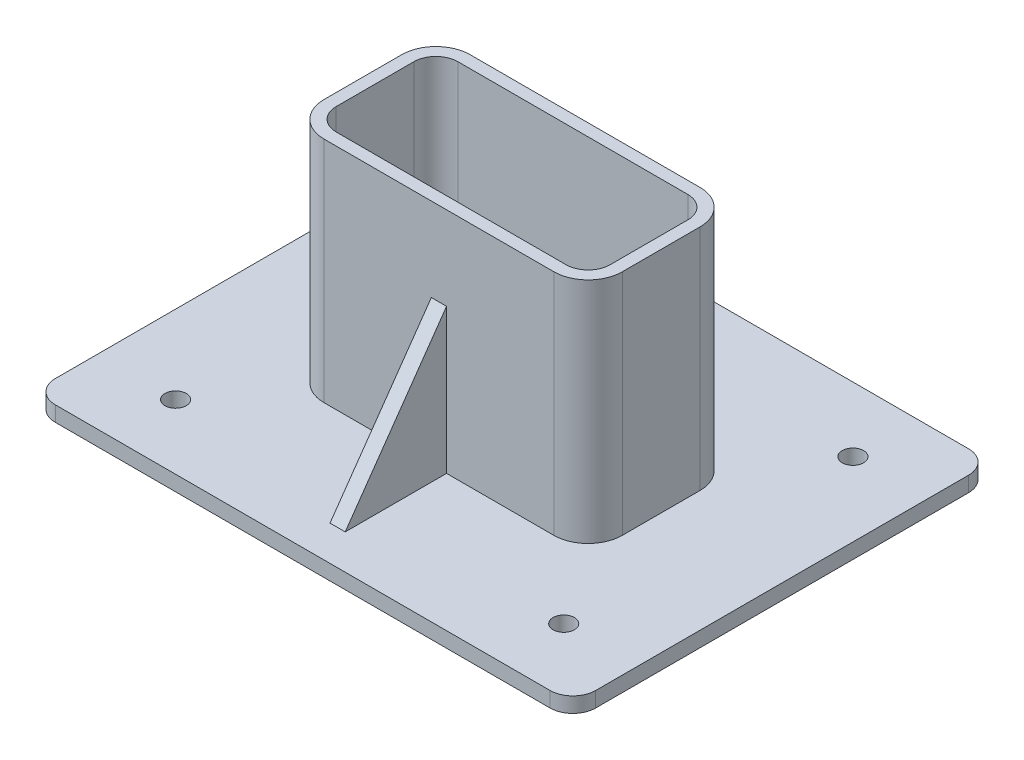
ISO-10303-21;
HEADER;
FILE_DESCRIPTION(('STEP AP214'),'2;1');
FILE_NAME('part.step','',(''),(''),'','','');
FILE_SCHEMA(('AUTOMOTIVE_DESIGN { 1 0 10303 214 1 1 1 1 }'));
ENDSEC;
DATA;
#1=APPLICATION_CONTEXT('core data for automotive mechanical design processes');
#2=APPLICATION_PROTOCOL_DEFINITION('international standard','automotive_design',2000,#1);
#3=PRODUCT_CONTEXT('',#1,'mechanical');
#4=PRODUCT('Part','Part','',(#3));
#5=PRODUCT_RELATED_PRODUCT_CATEGORY('part','',(#4));
#6=PRODUCT_DEFINITION_FORMATION('','',#4);
#7=PRODUCT_DEFINITION_CONTEXT('part definition',#1,'design');
#8=PRODUCT_DEFINITION('design','',#6,#7);
#9=PRODUCT_DEFINITION_SHAPE('','',#8);
#10=(LENGTH_UNIT() NAMED_UNIT(*) SI_UNIT(.MILLI.,.METRE.));
#11=(NAMED_UNIT(*) PLANE_ANGLE_UNIT() SI_UNIT($,.RADIAN.));
#12=(NAMED_UNIT(*) SI_UNIT($,.STERADIAN.) SOLID_ANGLE_UNIT());
#13=UNCERTAINTY_MEASURE_WITH_UNIT(LENGTH_MEASURE(1.E-05),#10,'distance_accuracy_value','');
#14=(GEOMETRIC_REPRESENTATION_CONTEXT(3) GLOBAL_UNCERTAINTY_ASSIGNED_CONTEXT((#13)) GLOBAL_UNIT_ASSIGNED_CONTEXT((#10,
#11,#12)) REPRESENTATION_CONTEXT('',''));
#15=CARTESIAN_POINT('',(0.,0.,0.));
#16=DIRECTION('',(0.,0.,1.));
#17=DIRECTION('',(1.,0.,0.));
#18=AXIS2_PLACEMENT_3D('',#15,#16,#17);
#19=CARTESIAN_POINT('',(90.,150.,0.));
#20=DIRECTION('',(1.,0.,0.));
#21=DIRECTION('',(0.,0.,-1.));
#22=AXIS2_PLACEMENT_3D('',#19,#20,#21);
#23=PLANE('',#22);
#24=DIRECTION('',(0.,0.,1.));
#25=VECTOR('',#24,1.);
#26=CARTESIAN_POINT('',(90.,0.,0.));
#27=LINE('',#26,#25);
#28=CARTESIAN_POINT('',(90.,0.,-25.5000000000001));
#29=VERTEX_POINT('',#28);
#30=CARTESIAN_POINT('',(90.,0.,25.5));
#31=VERTEX_POINT('',#30);
#32=EDGE_CURVE('E447',#29,#31,#27,.T.);
#33=ORIENTED_EDGE('',*,*,#32,.T.);
#34=DIRECTION('',(0.,-1.,0.));
#35=VECTOR('',#34,1.);
#36=CARTESIAN_POINT('',(90.,150.,25.5));
#37=LINE('',#36,#35);
#38=CARTESIAN_POINT('',(90.,150.,25.5));
#39=VERTEX_POINT('',#38);
#40=EDGE_CURVE('E503',#39,#31,#37,.T.);
#41=ORIENTED_EDGE('',*,*,#40,.F.);
#42=DIRECTION('',(0.,0.,1.));
#43=VECTOR('',#42,1.);
#44=CARTESIAN_POINT('',(90.,150.,0.));
#45=LINE('',#44,#43);
#46=CARTESIAN_POINT('',(90.,150.,-25.5000000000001));
#47=VERTEX_POINT('',#46);
#48=EDGE_CURVE('E387',#47,#39,#45,.T.);
#49=ORIENTED_EDGE('',*,*,#48,.F.);
#50=DIRECTION('',(0.,-1.,0.));
#51=VECTOR('',#50,1.);
#52=CARTESIAN_POINT('',(90.,150.,-25.5000000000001));
#53=LINE('',#52,#51);
#54=EDGE_CURVE('E474',#47,#29,#53,.T.);
#55=ORIENTED_EDGE('',*,*,#54,.T.);
#56=EDGE_LOOP('',(#33,#41,#49,#55));
#57=FACE_BOUND('',#56,.T.);
#58=ADVANCED_FACE('F53',(#57),#23,.F.);
#59=CARTESIAN_POINT('',(75.5,150.,25.5));
#60=DIRECTION('',(0.,-1.,0.));
#61=DIRECTION('',(0.,0.,-1.));
#62=AXIS2_PLACEMENT_3D('',#59,#60,#61);
#63=CYLINDRICAL_SURFACE('',#62,14.5);
#64=CARTESIAN_POINT('',(75.5,0.,25.5));
#65=DIRECTION('',(0.,1.,0.));
#66=DIRECTION('',(0.,0.,1.));
#67=AXIS2_PLACEMENT_3D('',#64,#65,#66);
#68=CIRCLE('',#67,14.5);
#69=CARTESIAN_POINT('',(75.5,0.,40.));
#70=VERTEX_POINT('',#69);
#71=EDGE_CURVE('E451',#31,#70,#68,.F.);
#72=ORIENTED_EDGE('',*,*,#71,.T.);
#73=DIRECTION('',(0.,-1.,0.));
#74=VECTOR('',#73,1.);
#75=CARTESIAN_POINT('',(75.5,150.,40.));
#76=LINE('',#75,#74);
#77=CARTESIAN_POINT('',(75.5,150.,40.));
#78=VERTEX_POINT('',#77);
#79=EDGE_CURVE('E499',#78,#70,#76,.T.);
#80=ORIENTED_EDGE('',*,*,#79,.F.);
#81=CARTESIAN_POINT('',(75.5,150.,25.5));
#82=DIRECTION('',(0.,1.,0.));
#83=DIRECTION('',(0.,0.,1.));
#84=AXIS2_PLACEMENT_3D('',#81,#82,#83);
#85=CIRCLE('',#84,14.5);
#86=EDGE_CURVE('E391',#39,#78,#85,.F.);
#87=ORIENTED_EDGE('',*,*,#86,.F.);
#88=ORIENTED_EDGE('',*,*,#40,.T.);
#89=EDGE_LOOP('',(#72,#80,#87,#88));
#90=FACE_BOUND('',#89,.T.);
#91=ADVANCED_FACE('F648',(#90),#63,.F.);
#92=CARTESIAN_POINT('',(0.,150.,40.));
#93=DIRECTION('',(0.,0.,-1.));
#94=DIRECTION('',(-1.,0.,0.));
#95=AXIS2_PLACEMENT_3D('',#92,#93,#94);
#96=PLANE('',#95);
#97=ORIENTED_EDGE('',*,*,#79,.T.);
#98=DIRECTION('',(1.,0.,0.));
#99=VECTOR('',#98,1.);
#100=CARTESIAN_POINT('',(0.,0.,40.));
#101=LINE('',#100,#99);
#102=CARTESIAN_POINT('',(-75.5,0.,40.0000000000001));
#103=VERTEX_POINT('',#102);
#104=EDGE_CURVE('E455',#103,#70,#101,.T.);
#105=ORIENTED_EDGE('',*,*,#104,.F.);
#106=DIRECTION('',(0.,-1.,0.));
#107=VECTOR('',#106,1.);
#108=CARTESIAN_POINT('',(-75.5,150.,40.0000000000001));
#109=LINE('',#108,#107);
#110=CARTESIAN_POINT('',(-75.5,150.,40.0000000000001));
#111=VERTEX_POINT('',#110);
#112=EDGE_CURVE('E495',#111,#103,#109,.T.);
#113=ORIENTED_EDGE('',*,*,#112,.F.);
#114=DIRECTION('',(1.,0.,0.));
#115=VECTOR('',#114,1.);
#116=CARTESIAN_POINT('',(0.,150.,40.));
#117=LINE('',#116,#115);
#118=EDGE_CURVE('E395',#111,#78,#117,.T.);
#119=ORIENTED_EDGE('',*,*,#118,.T.);
#120=EDGE_LOOP('',(#97,#105,#113,#119));
#121=FACE_BOUND('',#120,.T.);
#122=ADVANCED_FACE('F654',(#121),#96,.T.);
#123=CARTESIAN_POINT('',(-75.5,150.,25.5000000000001));
#124=DIRECTION('',(0.,-1.,0.));
#125=DIRECTION('',(0.,0.,-1.));
#126=AXIS2_PLACEMENT_3D('',#123,#124,#125);
#127=CYLINDRICAL_SURFACE('',#126,14.5);
#128=CARTESIAN_POINT('',(-75.5,0.,25.5000000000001));
#129=DIRECTION('',(0.,1.,0.));
#130=DIRECTION('',(0.,0.,1.));
#131=AXIS2_PLACEMENT_3D('',#128,#129,#130);
#132=CIRCLE('',#131,14.5);
#133=CARTESIAN_POINT('',(-90.,0.,25.5000000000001));
#134=VERTEX_POINT('',#133);
#135=EDGE_CURVE('E458',#134,#103,#132,.T.);
#136=ORIENTED_EDGE('',*,*,#135,.F.);
#137=DIRECTION('',(0.,-1.,0.));
#138=VECTOR('',#137,1.);
#139=CARTESIAN_POINT('',(-90.,150.,25.5000000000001));
#140=LINE('',#139,#138);
#141=CARTESIAN_POINT('',(-90.,150.,25.5000000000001));
#142=VERTEX_POINT('',#141);
#143=EDGE_CURVE('E491',#142,#134,#140,.T.);
#144=ORIENTED_EDGE('',*,*,#143,.F.);
#145=CARTESIAN_POINT('',(-75.5,150.,25.5000000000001));
#146=DIRECTION('',(0.,1.,0.));
#147=DIRECTION('',(0.,0.,1.));
#148=AXIS2_PLACEMENT_3D('',#145,#146,#147);
#149=CIRCLE('',#148,14.5);
#150=EDGE_CURVE('E398',#142,#111,#149,.T.);
#151=ORIENTED_EDGE('',*,*,#150,.T.);
#152=ORIENTED_EDGE('',*,*,#112,.T.);
#153=EDGE_LOOP('',(#136,#144,#151,#152));
#154=FACE_BOUND('',#153,.T.);
#155=ADVANCED_FACE('F761',(#154),#127,.F.);
#156=CARTESIAN_POINT('',(-90.,150.,0.));
#157=DIRECTION('',(1.,0.,0.));
#158=DIRECTION('',(0.,0.,-1.));
#159=AXIS2_PLACEMENT_3D('',#156,#157,#158);
#160=PLANE('',#159);
#161=DIRECTION('',(0.,0.,1.));
#162=VECTOR('',#161,1.);
#163=CARTESIAN_POINT('',(-90.,0.,0.));
#164=LINE('',#163,#162);
#165=CARTESIAN_POINT('',(-90.,0.,-25.5000000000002));
#166=VERTEX_POINT('',#165);
#167=EDGE_CURVE('E461',#166,#134,#164,.T.);
#168=ORIENTED_EDGE('',*,*,#167,.F.);
#169=DIRECTION('',(0.,-1.,0.));
#170=VECTOR('',#169,1.);
#171=CARTESIAN_POINT('',(-90.,150.,-25.5000000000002));
#172=LINE('',#171,#170);
#173=CARTESIAN_POINT('',(-90.,150.,-25.5000000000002));
#174=VERTEX_POINT('',#173);
#175=EDGE_CURVE('E487',#174,#166,#172,.T.);
#176=ORIENTED_EDGE('',*,*,#175,.F.);
#177=DIRECTION('',(0.,0.,1.));
#178=VECTOR('',#177,1.);
#179=CARTESIAN_POINT('',(-90.,150.,0.));
#180=LINE('',#179,#178);
#181=EDGE_CURVE('E402',#174,#142,#180,.T.);
#182=ORIENTED_EDGE('',*,*,#181,.T.);
#183=ORIENTED_EDGE('',*,*,#143,.T.);
#184=EDGE_LOOP('',(#168,#176,#182,#183));
#185=FACE_BOUND('',#184,.T.);
#186=ADVANCED_FACE('F757',(#185),#160,.T.);
#187=CARTESIAN_POINT('',(-75.5,150.,-25.5000000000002));
#188=DIRECTION('',(0.,-1.,0.));
#189=DIRECTION('',(0.,0.,-1.));
#190=AXIS2_PLACEMENT_3D('',#187,#188,#189);
#191=CYLINDRICAL_SURFACE('',#190,14.5);
#192=CARTESIAN_POINT('',(-75.5,0.,-25.5000000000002));
#193=DIRECTION('',(0.,1.,0.));
#194=DIRECTION('',(0.,0.,1.));
#195=AXIS2_PLACEMENT_3D('',#192,#193,#194);
#196=CIRCLE('',#195,14.5);
#197=CARTESIAN_POINT('',(-75.5,0.,-40.0000000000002));
#198=VERTEX_POINT('',#197);
#199=EDGE_CURVE('E464',#166,#198,#196,.F.);
#200=ORIENTED_EDGE('',*,*,#199,.T.);
#201=DIRECTION('',(0.,-1.,0.));
#202=VECTOR('',#201,1.);
#203=CARTESIAN_POINT('',(-75.5,150.,-40.0000000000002));
#204=LINE('',#203,#202);
#205=CARTESIAN_POINT('',(-75.5,150.,-40.0000000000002));
#206=VERTEX_POINT('',#205);
#207=EDGE_CURVE('E483',#206,#198,#204,.T.);
#208=ORIENTED_EDGE('',*,*,#207,.F.);
#209=CARTESIAN_POINT('',(-75.5,150.,-25.5000000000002));
#210=DIRECTION('',(0.,1.,0.));
#211=DIRECTION('',(0.,0.,1.));
#212=AXIS2_PLACEMENT_3D('',#209,#210,#211);
#213=CIRCLE('',#212,14.5);
#214=EDGE_CURVE('E406',#174,#206,#213,.F.);
#215=ORIENTED_EDGE('',*,*,#214,.F.);
#216=ORIENTED_EDGE('',*,*,#175,.T.);
#217=EDGE_LOOP('',(#200,#208,#215,#216));
#218=FACE_BOUND('',#217,.T.);
#219=ADVANCED_FACE('F753',(#218),#191,.F.);
#220=CARTESIAN_POINT('',(0.,150.,-40.0000000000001));
#221=DIRECTION('',(0.,0.,-1.));
#222=DIRECTION('',(-1.,0.,0.));
#223=AXIS2_PLACEMENT_3D('',#220,#221,#222);
#224=PLANE('',#223);
#225=DIRECTION('',(1.,0.,0.));
#226=VECTOR('',#225,1.);
#227=CARTESIAN_POINT('',(0.,0.,-40.0000000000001));
#228=LINE('',#227,#226);
#229=CARTESIAN_POINT('',(75.5,0.,-40.0000000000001));
#230=VERTEX_POINT('',#229);
#231=EDGE_CURVE('E468',#198,#230,#228,.T.);
#232=ORIENTED_EDGE('',*,*,#231,.T.);
#233=DIRECTION('',(0.,-1.,0.));
#234=VECTOR('',#233,1.);
#235=CARTESIAN_POINT('',(75.5,150.,-40.0000000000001));
#236=LINE('',#235,#234);
#237=CARTESIAN_POINT('',(75.5,150.,-40.0000000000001));
#238=VERTEX_POINT('',#237);
#239=EDGE_CURVE('E478',#238,#230,#236,.T.);
#240=ORIENTED_EDGE('',*,*,#239,.F.);
#241=DIRECTION('',(1.,0.,0.));
#242=VECTOR('',#241,1.);
#243=CARTESIAN_POINT('',(0.,150.,-40.0000000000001));
#244=LINE('',#243,#242);
#245=EDGE_CURVE('E409',#206,#238,#244,.T.);
#246=ORIENTED_EDGE('',*,*,#245,.F.);
#247=ORIENTED_EDGE('',*,*,#207,.T.);
#248=EDGE_LOOP('',(#232,#240,#246,#247));
#249=FACE_BOUND('',#248,.T.);
#250=ADVANCED_FACE('F681',(#249),#224,.F.);
#251=CARTESIAN_POINT('',(75.5,150.,25.5));
#252=DIRECTION('',(0.,-1.,0.));
#253=DIRECTION('',(0.,0.,-1.));
#254=AXIS2_PLACEMENT_3D('',#251,#252,#253);
#255=CYLINDRICAL_SURFACE('',#254,22.5);
#256=CARTESIAN_POINT('',(75.5,0.,25.5));
#257=DIRECTION('',(0.,1.,0.));
#258=DIRECTION('',(0.,0.,1.));
#259=AXIS2_PLACEMENT_3D('',#256,#257,#258);
#260=CIRCLE('',#259,22.5);
#261=CARTESIAN_POINT('',(98.,0.,25.5));
#262=VERTEX_POINT('',#261);
#263=CARTESIAN_POINT('',(75.5,0.,48.));
#264=VERTEX_POINT('',#263);
#265=EDGE_CURVE('E345',#262,#264,#260,.F.);
#266=ORIENTED_EDGE('',*,*,#265,.F.);
#267=DIRECTION('',(0.,-1.,0.));
#268=VECTOR('',#267,1.);
#269=CARTESIAN_POINT('',(98.,150.,25.5));
#270=LINE('',#269,#268);
#271=CARTESIAN_POINT('',(98.,150.,25.5));
#272=VERTEX_POINT('',#271);
#273=EDGE_CURVE('E479',#272,#262,#270,.T.);
#274=ORIENTED_EDGE('',*,*,#273,.F.);
#275=CARTESIAN_POINT('',(75.5,150.,25.5));
#276=DIRECTION('',(0.,1.,0.));
#277=DIRECTION('',(0.,0.,1.));
#278=AXIS2_PLACEMENT_3D('',#275,#276,#277);
#279=CIRCLE('',#278,22.5);
#280=CARTESIAN_POINT('',(75.5,150.,48.));
#281=VERTEX_POINT('',#280);
#282=EDGE_CURVE('E358',#272,#281,#279,.F.);
#283=ORIENTED_EDGE('',*,*,#282,.T.);
#284=DIRECTION('',(0.,-1.,0.));
#285=VECTOR('',#284,1.);
#286=CARTESIAN_POINT('',(75.5,150.,48.));
#287=LINE('',#286,#285);
#288=EDGE_CURVE('E416',#281,#264,#287,.T.);
#289=ORIENTED_EDGE('',*,*,#288,.T.);
#290=EDGE_LOOP('',(#266,#274,#283,#289));
#291=FACE_BOUND('',#290,.T.);
#292=ADVANCED_FACE('F621',(#291),#255,.T.);
#293=CARTESIAN_POINT('',(98.,150.,0.));
#294=DIRECTION('',(1.,0.,0.));
#295=DIRECTION('',(0.,0.,-1.));
#296=AXIS2_PLACEMENT_3D('',#293,#294,#295);
#297=PLANE('',#296);
#298=DIRECTION('',(0.,0.,1.));
#299=VECTOR('',#298,1.);
#300=CARTESIAN_POINT('',(98.,0.,0.));
#301=LINE('',#300,#299);
#302=CARTESIAN_POINT('',(98.,0.,-25.5000000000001));
#303=VERTEX_POINT('',#302);
#304=EDGE_CURVE('E420',#303,#262,#301,.T.);
#305=ORIENTED_EDGE('',*,*,#304,.F.);
#306=DIRECTION('',(0.,-1.,0.));
#307=VECTOR('',#306,1.);
#308=CARTESIAN_POINT('',(98.,150.,-25.5000000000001));
#309=LINE('',#308,#307);
#310=CARTESIAN_POINT('',(98.,150.,-25.5000000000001));
#311=VERTEX_POINT('',#310);
#312=EDGE_CURVE('E529',#311,#303,#309,.T.);
#313=ORIENTED_EDGE('',*,*,#312,.F.);
#314=DIRECTION('',(0.,0.,1.));
#315=VECTOR('',#314,1.);
#316=CARTESIAN_POINT('',(98.,150.,0.));
#317=LINE('',#316,#315);
#318=EDGE_CURVE('E362',#311,#272,#317,.T.);
#319=ORIENTED_EDGE('',*,*,#318,.T.);
#320=ORIENTED_EDGE('',*,*,#273,.T.);
#321=EDGE_LOOP('',(#305,#313,#319,#320));
#322=FACE_BOUND('',#321,.T.);
#323=ADVANCED_FACE('F618',(#322),#297,.T.);
#324=CARTESIAN_POINT('',(75.5,150.,-25.5000000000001));
#325=DIRECTION('',(0.,-1.,0.));
#326=DIRECTION('',(0.,0.,-1.));
#327=AXIS2_PLACEMENT_3D('',#324,#325,#326);
#328=CYLINDRICAL_SURFACE('',#327,22.5);
#329=CARTESIAN_POINT('',(75.5,0.,-25.5000000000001));
#330=DIRECTION('',(0.,1.,0.));
#331=DIRECTION('',(0.,0.,1.));
#332=AXIS2_PLACEMENT_3D('',#329,#330,#331);
#333=CIRCLE('',#332,22.5);
#334=CARTESIAN_POINT('',(75.5,0.,-48.0000000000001));
#335=VERTEX_POINT('',#334);
#336=EDGE_CURVE('E424',#303,#335,#333,.T.);
#337=ORIENTED_EDGE('',*,*,#336,.T.);
#338=DIRECTION('',(0.,-1.,0.));
#339=VECTOR('',#338,1.);
#340=CARTESIAN_POINT('',(75.5,150.,-48.0000000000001));
#341=LINE('',#340,#339);
#342=CARTESIAN_POINT('',(75.5,150.,-48.0000000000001));
#343=VERTEX_POINT('',#342);
#344=EDGE_CURVE('E525',#343,#335,#341,.T.);
#345=ORIENTED_EDGE('',*,*,#344,.F.);
#346=CARTESIAN_POINT('',(75.5,150.,-25.5000000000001));
#347=DIRECTION('',(0.,1.,0.));
#348=DIRECTION('',(0.,0.,1.));
#349=AXIS2_PLACEMENT_3D('',#346,#347,#348);
#350=CIRCLE('',#349,22.5);
#351=EDGE_CURVE('E367',#311,#343,#350,.T.);
#352=ORIENTED_EDGE('',*,*,#351,.F.);
#353=ORIENTED_EDGE('',*,*,#312,.T.);
#354=EDGE_LOOP('',(#337,#345,#352,#353));
#355=FACE_BOUND('',#354,.T.);
#356=ADVANCED_FACE('F614',(#355),#328,.T.);
#357=CARTESIAN_POINT('',(0.,150.,-48.0000000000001));
#358=DIRECTION('',(0.,0.,-1.));
#359=DIRECTION('',(-1.,0.,0.));
#360=AXIS2_PLACEMENT_3D('',#357,#358,#359);
#361=PLANE('',#360);
#362=DIRECTION('',(0.,-1.,0.));
#363=VECTOR('',#362,1.);
#364=CARTESIAN_POINT('',(5.,150.,-48.0000000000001));
#365=LINE('',#364,#363);
#366=CARTESIAN_POINT('',(5.,95.0840403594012,-48.0000000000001));
#367=VERTEX_POINT('',#366);
#368=CARTESIAN_POINT('',(5.,0.,-48.0000000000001));
#369=VERTEX_POINT('',#368);
#370=EDGE_CURVE('E272',#367,#369,#365,.T.);
#371=ORIENTED_EDGE('',*,*,#370,.F.);
#372=DIRECTION('',(-1.,0.,0.));
#373=VECTOR('',#372,1.);
#374=CARTESIAN_POINT('',(0.,95.0840403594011,-48.0000000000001));
#375=LINE('',#374,#373);
#376=CARTESIAN_POINT('',(-5.,95.0840403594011,-48.0000000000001));
#377=VERTEX_POINT('',#376);
#378=EDGE_CURVE('E263',#377,#367,#375,.F.);
#379=ORIENTED_EDGE('',*,*,#378,.F.);
#380=DIRECTION('',(0.,-1.,0.));
#381=VECTOR('',#380,1.);
#382=CARTESIAN_POINT('',(-5.,150.,-48.0000000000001));
#383=LINE('',#382,#381);
#384=CARTESIAN_POINT('',(-5.,0.,-48.0000000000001));
#385=VERTEX_POINT('',#384);
#386=EDGE_CURVE('E249',#377,#385,#383,.T.);
#387=ORIENTED_EDGE('',*,*,#386,.T.);
#388=DIRECTION('',(1.,0.,0.));
#389=VECTOR('',#388,1.);
#390=CARTESIAN_POINT('',(0.,0.,-48.0000000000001));
#391=LINE('',#390,#389);
#392=CARTESIAN_POINT('',(-75.5,0.,-48.0000000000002));
#393=VERTEX_POINT('',#392);
#394=EDGE_CURVE('E429',#393,#385,#391,.T.);
#395=ORIENTED_EDGE('',*,*,#394,.F.);
#396=DIRECTION('',(0.,-1.,0.));
#397=VECTOR('',#396,1.);
#398=CARTESIAN_POINT('',(-75.5,150.,-48.0000000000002));
#399=LINE('',#398,#397);
#400=CARTESIAN_POINT('',(-75.5,150.,-48.0000000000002));
#401=VERTEX_POINT('',#400);
#402=EDGE_CURVE('E522',#401,#393,#399,.T.);
#403=ORIENTED_EDGE('',*,*,#402,.F.);
#404=DIRECTION('',(1.,0.,0.));
#405=VECTOR('',#404,1.);
#406=CARTESIAN_POINT('',(0.,150.,-48.0000000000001));
#407=LINE('',#406,#405);
#408=EDGE_CURVE('E371',#401,#343,#407,.T.);
#409=ORIENTED_EDGE('',*,*,#408,.T.);
#410=ORIENTED_EDGE('',*,*,#344,.T.);
#411=EDGE_CURVE('E428',#369,#335,#391,.T.);
#412=ORIENTED_EDGE('',*,*,#411,.F.);
#413=EDGE_LOOP('',(#371,#379,#387,#395,#403,#409,#410,#412));
#414=FACE_BOUND('',#413,.T.);
#415=ADVANCED_FACE('F270',(#414),#361,.T.);
#416=CARTESIAN_POINT('',(-75.5,150.,-25.5000000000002));
#417=DIRECTION('',(0.,-1.,0.));
#418=DIRECTION('',(0.,0.,-1.));
#419=AXIS2_PLACEMENT_3D('',#416,#417,#418);
#420=CYLINDRICAL_SURFACE('',#419,22.5);
#421=CARTESIAN_POINT('',(-75.5,0.,-25.5000000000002));
#422=DIRECTION('',(0.,1.,0.));
#423=DIRECTION('',(0.,0.,1.));
#424=AXIS2_PLACEMENT_3D('',#421,#422,#423);
#425=CIRCLE('',#424,22.5);
#426=CARTESIAN_POINT('',(-98.,0.,-25.5000000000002));
#427=VERTEX_POINT('',#426);
#428=EDGE_CURVE('E432',#427,#393,#425,.F.);
#429=ORIENTED_EDGE('',*,*,#428,.F.);
#430=DIRECTION('',(0.,-1.,0.));
#431=VECTOR('',#430,1.);
#432=CARTESIAN_POINT('',(-98.,150.,-25.5000000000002));
#433=LINE('',#432,#431);
#434=CARTESIAN_POINT('',(-98.,150.,-25.5000000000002));
#435=VERTEX_POINT('',#434);
#436=EDGE_CURVE('E519',#435,#427,#433,.T.);
#437=ORIENTED_EDGE('',*,*,#436,.F.);
#438=CARTESIAN_POINT('',(-75.5,150.,-25.5000000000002));
#439=DIRECTION('',(0.,1.,0.));
#440=DIRECTION('',(0.,0.,1.));
#441=AXIS2_PLACEMENT_3D('',#438,#439,#440);
#442=CIRCLE('',#441,22.5);
#443=EDGE_CURVE('E374',#435,#401,#442,.F.);
#444=ORIENTED_EDGE('',*,*,#443,.T.);
#445=ORIENTED_EDGE('',*,*,#402,.T.);
#446=EDGE_LOOP('',(#429,#437,#444,#445));
#447=FACE_BOUND('',#446,.T.);
#448=ADVANCED_FACE('F668',(#447),#420,.T.);
#449=CARTESIAN_POINT('',(-98.,150.,0.));
#450=DIRECTION('',(1.,0.,0.));
#451=DIRECTION('',(0.,0.,-1.));
#452=AXIS2_PLACEMENT_3D('',#449,#450,#451);
#453=PLANE('',#452);
#454=DIRECTION('',(0.,0.,1.));
#455=VECTOR('',#454,1.);
#456=CARTESIAN_POINT('',(-98.,0.,0.));
#457=LINE('',#456,#455);
#458=CARTESIAN_POINT('',(-98.,0.,25.5000000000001));
#459=VERTEX_POINT('',#458);
#460=EDGE_CURVE('E436',#427,#459,#457,.T.);
#461=ORIENTED_EDGE('',*,*,#460,.T.);
#462=DIRECTION('',(0.,-1.,0.));
#463=VECTOR('',#462,1.);
#464=CARTESIAN_POINT('',(-98.,150.,25.5000000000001));
#465=LINE('',#464,#463);
#466=CARTESIAN_POINT('',(-98.,150.,25.5000000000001));
#467=VERTEX_POINT('',#466);
#468=EDGE_CURVE('E515',#467,#459,#465,.T.);
#469=ORIENTED_EDGE('',*,*,#468,.F.);
#470=DIRECTION('',(0.,0.,1.));
#471=VECTOR('',#470,1.);
#472=CARTESIAN_POINT('',(-98.,150.,0.));
#473=LINE('',#472,#471);
#474=EDGE_CURVE('E378',#435,#467,#473,.T.);
#475=ORIENTED_EDGE('',*,*,#474,.F.);
#476=ORIENTED_EDGE('',*,*,#436,.T.);
#477=EDGE_LOOP('',(#461,#469,#475,#476));
#478=FACE_BOUND('',#477,.T.);
#479=ADVANCED_FACE('F665',(#478),#453,.F.);
#480=CARTESIAN_POINT('',(-75.5,150.,25.5000000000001));
#481=DIRECTION('',(0.,-1.,0.));
#482=DIRECTION('',(0.,0.,-1.));
#483=AXIS2_PLACEMENT_3D('',#480,#481,#482);
#484=CYLINDRICAL_SURFACE('',#483,22.5);
#485=CARTESIAN_POINT('',(-75.5,0.,25.5000000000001));
#486=DIRECTION('',(0.,1.,0.));
#487=DIRECTION('',(0.,0.,1.));
#488=AXIS2_PLACEMENT_3D('',#485,#486,#487);
#489=CIRCLE('',#488,22.5);
#490=CARTESIAN_POINT('',(-75.5,0.,48.0000000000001));
#491=VERTEX_POINT('',#490);
#492=EDGE_CURVE('E439',#459,#491,#489,.T.);
#493=ORIENTED_EDGE('',*,*,#492,.T.);
#494=DIRECTION('',(0.,-1.,0.));
#495=VECTOR('',#494,1.);
#496=CARTESIAN_POINT('',(-75.5,150.,48.0000000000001));
#497=LINE('',#496,#495);
#498=CARTESIAN_POINT('',(-75.5,150.,48.0000000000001));
#499=VERTEX_POINT('',#498);
#500=EDGE_CURVE('E511',#499,#491,#497,.T.);
#501=ORIENTED_EDGE('',*,*,#500,.F.);
#502=CARTESIAN_POINT('',(-75.5,150.,25.5000000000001));
#503=DIRECTION('',(0.,1.,0.));
#504=DIRECTION('',(0.,0.,1.));
#505=AXIS2_PLACEMENT_3D('',#502,#503,#504);
#506=CIRCLE('',#505,22.5);
#507=EDGE_CURVE('E381',#467,#499,#506,.T.);
#508=ORIENTED_EDGE('',*,*,#507,.F.);
#509=ORIENTED_EDGE('',*,*,#468,.T.);
#510=EDGE_LOOP('',(#493,#501,#508,#509));
#511=FACE_BOUND('',#510,.T.);
#512=ADVANCED_FACE('F662',(#511),#484,.T.);
#513=CARTESIAN_POINT('',(0.,150.,48.));
#514=DIRECTION('',(0.,0.,-1.));
#515=DIRECTION('',(-1.,0.,0.));
#516=AXIS2_PLACEMENT_3D('',#513,#514,#515);
#517=PLANE('',#516);
#518=ORIENTED_EDGE('',*,*,#288,.F.);
#519=DIRECTION('',(1.,0.,0.));
#520=VECTOR('',#519,1.);
#521=CARTESIAN_POINT('',(0.,150.,48.));
#522=LINE('',#521,#520);
#523=EDGE_CURVE('E384',#499,#281,#522,.T.);
#524=ORIENTED_EDGE('',*,*,#523,.F.);
#525=ORIENTED_EDGE('',*,*,#500,.T.);
#526=DIRECTION('',(1.,0.,0.));
#527=VECTOR('',#526,1.);
#528=CARTESIAN_POINT('',(0.,0.,48.));
#529=LINE('',#528,#527);
#530=CARTESIAN_POINT('',(-5.,0.,48.));
#531=VERTEX_POINT('',#530);
#532=EDGE_CURVE('E443',#491,#531,#529,.T.);
#533=ORIENTED_EDGE('',*,*,#532,.T.);
#534=DIRECTION('',(0.,-1.,0.));
#535=VECTOR('',#534,1.);
#536=CARTESIAN_POINT('',(-5.,150.,48.));
#537=LINE('',#536,#535);
#538=CARTESIAN_POINT('',(-5.,95.0840403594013,48.));
#539=VERTEX_POINT('',#538);
#540=EDGE_CURVE('E76',#539,#531,#537,.T.);
#541=ORIENTED_EDGE('',*,*,#540,.F.);
#542=DIRECTION('',(1.,0.,0.));
#543=VECTOR('',#542,1.);
#544=CARTESIAN_POINT('',(0.,95.0840403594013,48.));
#545=LINE('',#544,#543);
#546=CARTESIAN_POINT('',(5.,95.0840403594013,48.));
#547=VERTEX_POINT('',#546);
#548=EDGE_CURVE('E293',#539,#547,#545,.T.);
#549=ORIENTED_EDGE('',*,*,#548,.T.);
#550=DIRECTION('',(0.,-1.,0.));
#551=VECTOR('',#550,1.);
#552=CARTESIAN_POINT('',(5.,150.,48.));
#553=LINE('',#552,#551);
#554=CARTESIAN_POINT('',(5.,0.,48.));
#555=VERTEX_POINT('',#554);
#556=EDGE_CURVE('E289',#547,#555,#553,.T.);
#557=ORIENTED_EDGE('',*,*,#556,.T.);
#558=EDGE_CURVE('E442',#555,#264,#529,.T.);
#559=ORIENTED_EDGE('',*,*,#558,.T.);
#560=EDGE_LOOP('',(#518,#524,#525,#533,#541,#549,#557,#559));
#561=FACE_BOUND('',#560,.T.);
#562=ADVANCED_FACE('F603',(#561),#517,.F.);
#563=CARTESIAN_POINT('',(75.5,150.,-25.5000000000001));
#564=DIRECTION('',(0.,-1.,0.));
#565=DIRECTION('',(0.,0.,-1.));
#566=AXIS2_PLACEMENT_3D('',#563,#564,#565);
#567=CYLINDRICAL_SURFACE('',#566,14.5);
#568=CARTESIAN_POINT('',(75.5,0.,-25.5000000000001));
#569=DIRECTION('',(0.,1.,0.));
#570=DIRECTION('',(0.,0.,1.));
#571=AXIS2_PLACEMENT_3D('',#568,#569,#570);
#572=CIRCLE('',#571,14.5);
#573=EDGE_CURVE('E363',#29,#230,#572,.T.);
#574=ORIENTED_EDGE('',*,*,#573,.F.);
#575=ORIENTED_EDGE('',*,*,#54,.F.);
#576=CARTESIAN_POINT('',(75.5,150.,-25.5000000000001));
#577=DIRECTION('',(0.,1.,0.));
#578=DIRECTION('',(0.,0.,1.));
#579=AXIS2_PLACEMENT_3D('',#576,#577,#578);
#580=CIRCLE('',#579,14.5);
#581=EDGE_CURVE('E412',#47,#238,#580,.T.);
#582=ORIENTED_EDGE('',*,*,#581,.T.);
#583=ORIENTED_EDGE('',*,*,#239,.T.);
#584=EDGE_LOOP('',(#574,#575,#582,#583));
#585=FACE_BOUND('',#584,.T.);
#586=ADVANCED_FACE('F661',(#585),#567,.F.);
#587=CARTESIAN_POINT('',(0.,150.,0.));
#588=DIRECTION('',(0.,1.,0.));
#589=DIRECTION('',(0.,0.,1.));
#590=AXIS2_PLACEMENT_3D('',#587,#588,#589);
#591=PLANE('',#590);
#592=ORIENTED_EDGE('',*,*,#86,.T.);
#593=ORIENTED_EDGE('',*,*,#118,.F.);
#594=ORIENTED_EDGE('',*,*,#150,.F.);
#595=ORIENTED_EDGE('',*,*,#181,.F.);
#596=ORIENTED_EDGE('',*,*,#214,.T.);
#597=ORIENTED_EDGE('',*,*,#245,.T.);
#598=ORIENTED_EDGE('',*,*,#581,.F.);
#599=ORIENTED_EDGE('',*,*,#48,.T.);
#600=EDGE_LOOP('',(#592,#593,#594,#595,#596,#597,#598,#599));
#601=FACE_BOUND('',#600,.T.);
#602=ORIENTED_EDGE('',*,*,#523,.T.);
#603=ORIENTED_EDGE('',*,*,#282,.F.);
#604=ORIENTED_EDGE('',*,*,#318,.F.);
#605=ORIENTED_EDGE('',*,*,#351,.T.);
#606=ORIENTED_EDGE('',*,*,#408,.F.);
#607=ORIENTED_EDGE('',*,*,#443,.F.);
#608=ORIENTED_EDGE('',*,*,#474,.T.);
#609=ORIENTED_EDGE('',*,*,#507,.T.);
#610=EDGE_LOOP('',(#602,#603,#604,#605,#606,#607,#608,#609));
#611=FACE_BOUND('',#610,.T.);
#612=ADVANCED_FACE('F623',(#601,#611),#591,.T.);
#613=CARTESIAN_POINT('',(0.,0.,0.));
#614=DIRECTION('',(0.,1.,0.));
#615=DIRECTION('',(0.,0.,1.));
#616=AXIS2_PLACEMENT_3D('',#613,#614,#615);
#617=PLANE('',#616);
#618=ORIENTED_EDGE('',*,*,#573,.T.);
#619=ORIENTED_EDGE('',*,*,#231,.F.);
#620=ORIENTED_EDGE('',*,*,#199,.F.);
#621=ORIENTED_EDGE('',*,*,#167,.T.);
#622=ORIENTED_EDGE('',*,*,#135,.T.);
#623=ORIENTED_EDGE('',*,*,#104,.T.);
#624=ORIENTED_EDGE('',*,*,#71,.F.);
#625=ORIENTED_EDGE('',*,*,#32,.F.);
#626=EDGE_LOOP('',(#618,#619,#620,#621,#622,#623,#624,#625));
#627=FACE_BOUND('',#626,.T.);
#628=ADVANCED_FACE('F738',(#627),#617,.T.);
#629=CARTESIAN_POINT('',(-177.5,-10.,137.5));
#630=DIRECTION('',(-1.,0.,0.));
#631=DIRECTION('',(0.,0.,1.));
#632=AXIS2_PLACEMENT_3D('',#629,#630,#631);
#633=PLANE('',#632);
#634=DIRECTION('',(0.,0.,1.));
#635=VECTOR('',#634,1.);
#636=CARTESIAN_POINT('',(-177.5,0.,137.5));
#637=LINE('',#636,#635);
#638=CARTESIAN_POINT('',(-177.5,0.,-122.5));
#639=VERTEX_POINT('',#638);
#640=CARTESIAN_POINT('',(-177.5,0.,122.5));
#641=VERTEX_POINT('',#640);
#642=EDGE_CURVE('E326',#639,#641,#637,.T.);
#643=ORIENTED_EDGE('',*,*,#642,.F.);
#644=DIRECTION('',(0.,1.,0.));
#645=VECTOR('',#644,1.);
#646=CARTESIAN_POINT('',(-177.5,-10.,-122.5));
#647=LINE('',#646,#645);
#648=CARTESIAN_POINT('',(-177.5,-10.,-122.5));
#649=VERTEX_POINT('',#648);
#650=EDGE_CURVE('E585',#639,#649,#647,.F.);
#651=ORIENTED_EDGE('',*,*,#650,.T.);
#652=DIRECTION('',(0.,0.,1.));
#653=VECTOR('',#652,1.);
#654=CARTESIAN_POINT('',(-177.5,-10.,137.5));
#655=LINE('',#654,#653);
#656=CARTESIAN_POINT('',(-177.5,-10.,122.5));
#657=VERTEX_POINT('',#656);
#658=EDGE_CURVE('E330',#649,#657,#655,.T.);
#659=ORIENTED_EDGE('',*,*,#658,.T.);
#660=DIRECTION('',(0.,1.,0.));
#661=VECTOR('',#660,1.);
#662=CARTESIAN_POINT('',(-177.5,-10.,122.5));
#663=LINE('',#662,#661);
#664=EDGE_CURVE('E581',#657,#641,#663,.T.);
#665=ORIENTED_EDGE('',*,*,#664,.T.);
#666=EDGE_LOOP('',(#643,#651,#659,#665));
#667=FACE_BOUND('',#666,.T.);
#668=ADVANCED_FACE('F712',(#667),#633,.T.);
#669=CARTESIAN_POINT('',(177.5,-10.,-137.5));
#670=DIRECTION('',(0.,0.,-1.));
#671=DIRECTION('',(-1.,0.,0.));
#672=AXIS2_PLACEMENT_3D('',#669,#670,#671);
#673=PLANE('',#672);
#674=DIRECTION('',(-1.,0.,0.));
#675=VECTOR('',#674,1.);
#676=CARTESIAN_POINT('',(177.5,-10.,-137.5));
#677=LINE('',#676,#675);
#678=CARTESIAN_POINT('',(162.5,-10.,-137.5));
#679=VERTEX_POINT('',#678);
#680=CARTESIAN_POINT('',(-162.5,-10.,-137.5));
#681=VERTEX_POINT('',#680);
#682=EDGE_CURVE('E342',#679,#681,#677,.T.);
#683=ORIENTED_EDGE('',*,*,#682,.T.);
#684=DIRECTION('',(0.,1.,0.));
#685=VECTOR('',#684,1.);
#686=CARTESIAN_POINT('',(-162.5,-10.,-137.5));
#687=LINE('',#686,#685);
#688=CARTESIAN_POINT('',(-162.5,0.,-137.5));
#689=VERTEX_POINT('',#688);
#690=EDGE_CURVE('E574',#681,#689,#687,.T.);
#691=ORIENTED_EDGE('',*,*,#690,.T.);
#692=DIRECTION('',(-1.,0.,0.));
#693=VECTOR('',#692,1.);
#694=CARTESIAN_POINT('',(177.5,0.,-137.5));
#695=LINE('',#694,#693);
#696=CARTESIAN_POINT('',(162.5,0.,-137.5));
#697=VERTEX_POINT('',#696);
#698=EDGE_CURVE('E335',#697,#689,#695,.T.);
#699=ORIENTED_EDGE('',*,*,#698,.F.);
#700=DIRECTION('',(0.,1.,0.));
#701=VECTOR('',#700,1.);
#702=CARTESIAN_POINT('',(162.5,-10.,-137.5));
#703=LINE('',#702,#701);
#704=EDGE_CURVE('E578',#697,#679,#703,.F.);
#705=ORIENTED_EDGE('',*,*,#704,.T.);
#706=EDGE_LOOP('',(#683,#691,#699,#705));
#707=FACE_BOUND('',#706,.T.);
#708=ADVANCED_FACE('F730',(#707),#673,.T.);
#709=CARTESIAN_POINT('',(177.5,-10.,137.5));
#710=DIRECTION('',(1.,0.,0.));
#711=DIRECTION('',(0.,0.,-1.));
#712=AXIS2_PLACEMENT_3D('',#709,#710,#711);
#713=PLANE('',#712);
#714=DIRECTION('',(0.,0.,-1.));
#715=VECTOR('',#714,1.);
#716=CARTESIAN_POINT('',(177.5,0.,137.5));
#717=LINE('',#716,#715);
#718=CARTESIAN_POINT('',(177.5,0.,122.5));
#719=VERTEX_POINT('',#718);
#720=CARTESIAN_POINT('',(177.5,0.,-122.5));
#721=VERTEX_POINT('',#720);
#722=EDGE_CURVE('E352',#719,#721,#717,.T.);
#723=ORIENTED_EDGE('',*,*,#722,.F.);
#724=DIRECTION('',(0.,1.,0.));
#725=VECTOR('',#724,1.);
#726=CARTESIAN_POINT('',(177.5,-10.,122.5));
#727=LINE('',#726,#725);
#728=CARTESIAN_POINT('',(177.5,-10.,122.5));
#729=VERTEX_POINT('',#728);
#730=EDGE_CURVE('E557',#719,#729,#727,.F.);
#731=ORIENTED_EDGE('',*,*,#730,.T.);
#732=DIRECTION('',(0.,0.,-1.));
#733=VECTOR('',#732,1.);
#734=CARTESIAN_POINT('',(177.5,-10.,137.5));
#735=LINE('',#734,#733);
#736=CARTESIAN_POINT('',(177.5,-10.,-122.5));
#737=VERTEX_POINT('',#736);
#738=EDGE_CURVE('E338',#729,#737,#735,.T.);
#739=ORIENTED_EDGE('',*,*,#738,.T.);
#740=DIRECTION('',(0.,1.,0.));
#741=VECTOR('',#740,1.);
#742=CARTESIAN_POINT('',(177.5,-10.,-122.5));
#743=LINE('',#742,#741);
#744=EDGE_CURVE('E553',#737,#721,#743,.T.);
#745=ORIENTED_EDGE('',*,*,#744,.T.);
#746=EDGE_LOOP('',(#723,#731,#739,#745));
#747=FACE_BOUND('',#746,.T.);
#748=ADVANCED_FACE('F724',(#747),#713,.T.);
#749=CARTESIAN_POINT('',(177.5,-10.,137.5));
#750=DIRECTION('',(0.,0.,1.));
#751=DIRECTION('',(1.,0.,0.));
#752=AXIS2_PLACEMENT_3D('',#749,#750,#751);
#753=PLANE('',#752);
#754=DIRECTION('',(0.,1.,0.));
#755=VECTOR('',#754,1.);
#756=CARTESIAN_POINT('',(162.5,-10.,137.5));
#757=LINE('',#756,#755);
#758=CARTESIAN_POINT('',(162.5,-10.,137.5));
#759=VERTEX_POINT('',#758);
#760=CARTESIAN_POINT('',(162.5,0.,137.5));
#761=VERTEX_POINT('',#760);
#762=EDGE_CURVE('E537',#759,#761,#757,.T.);
#763=ORIENTED_EDGE('',*,*,#762,.T.);
#764=DIRECTION('',(1.,0.,0.));
#765=VECTOR('',#764,1.);
#766=CARTESIAN_POINT('',(177.5,0.,137.5));
#767=LINE('',#766,#765);
#768=CARTESIAN_POINT('',(-162.5,0.,137.5));
#769=VERTEX_POINT('',#768);
#770=EDGE_CURVE('E349',#769,#761,#767,.T.);
#771=ORIENTED_EDGE('',*,*,#770,.F.);
#772=DIRECTION('',(0.,1.,0.));
#773=VECTOR('',#772,1.);
#774=CARTESIAN_POINT('',(-162.5,-10.,137.5));
#775=LINE('',#774,#773);
#776=CARTESIAN_POINT('',(-162.5,-10.,137.5));
#777=VERTEX_POINT('',#776);
#778=EDGE_CURVE('E507',#769,#777,#775,.F.);
#779=ORIENTED_EDGE('',*,*,#778,.T.);
#780=DIRECTION('',(1.,0.,0.));
#781=VECTOR('',#780,1.);
#782=CARTESIAN_POINT('',(177.5,-10.,137.5));
#783=LINE('',#782,#781);
#784=EDGE_CURVE('E334',#777,#759,#783,.T.);
#785=ORIENTED_EDGE('',*,*,#784,.T.);
#786=EDGE_LOOP('',(#763,#771,#779,#785));
#787=FACE_BOUND('',#786,.T.);
#788=ADVANCED_FACE('F718',(#787),#753,.T.);
#789=CARTESIAN_POINT('',(0.,-10.,0.));
#790=DIRECTION('',(0.,1.,0.));
#791=DIRECTION('',(0.,0.,1.));
#792=AXIS2_PLACEMENT_3D('',#789,#790,#791);
#793=PLANE('',#792);
#794=CARTESIAN_POINT('',(162.5,-10.,122.5));
#795=DIRECTION('',(0.,1.,0.));
#796=DIRECTION('',(0.,0.,1.));
#797=AXIS2_PLACEMENT_3D('',#794,#795,#796);
#798=CIRCLE('',#797,15.);
#799=EDGE_CURVE('E570',#729,#759,#798,.F.);
#800=ORIENTED_EDGE('',*,*,#799,.T.);
#801=ORIENTED_EDGE('',*,*,#784,.F.);
#802=CARTESIAN_POINT('',(-162.5,-10.,122.5));
#803=DIRECTION('',(0.,1.,0.));
#804=DIRECTION('',(0.,0.,1.));
#805=AXIS2_PLACEMENT_3D('',#802,#803,#804);
#806=CIRCLE('',#805,15.);
#807=EDGE_CURVE('E560',#777,#657,#806,.F.);
#808=ORIENTED_EDGE('',*,*,#807,.T.);
#809=ORIENTED_EDGE('',*,*,#658,.F.);
#810=CARTESIAN_POINT('',(-162.5,-10.,-122.5));
#811=DIRECTION('',(0.,1.,0.));
#812=DIRECTION('',(0.,0.,1.));
#813=AXIS2_PLACEMENT_3D('',#810,#811,#812);
#814=CIRCLE('',#813,15.);
#815=EDGE_CURVE('E563',#649,#681,#814,.F.);
#816=ORIENTED_EDGE('',*,*,#815,.T.);
#817=ORIENTED_EDGE('',*,*,#682,.F.);
#818=CARTESIAN_POINT('',(162.5,-10.,-122.5));
#819=DIRECTION('',(0.,1.,0.));
#820=DIRECTION('',(0.,0.,1.));
#821=AXIS2_PLACEMENT_3D('',#818,#819,#820);
#822=CIRCLE('',#821,15.);
#823=EDGE_CURVE('E567',#679,#737,#822,.F.);
#824=ORIENTED_EDGE('',*,*,#823,.T.);
#825=ORIENTED_EDGE('',*,*,#738,.F.);
#826=EDGE_LOOP('',(#800,#801,#808,#809,#816,#817,#824,#825));
#827=FACE_BOUND('',#826,.T.);
#828=CARTESIAN_POINT('',(-126.020408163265,-10.,-95.));
#829=DIRECTION('',(0.,1.,0.));
#830=DIRECTION('',(0.,0.,-1.));
#831=AXIS2_PLACEMENT_3D('',#828,#829,#830);
#832=CIRCLE('',#831,7.);
#833=CARTESIAN_POINT('',(-126.020408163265,-10.,-102.));
#834=VERTEX_POINT('',#833);
#835=EDGE_CURVE('E315',#834,#834,#832,.T.);
#836=ORIENTED_EDGE('',*,*,#835,.T.);
#837=EDGE_LOOP('',(#836));
#838=FACE_BOUND('',#837,.T.);
#839=CARTESIAN_POINT('',(128.979591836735,-10.,-95.));
#840=DIRECTION('',(0.,1.,0.));
#841=DIRECTION('',(0.,0.,-1.));
#842=AXIS2_PLACEMENT_3D('',#839,#840,#841);
#843=CIRCLE('',#842,7.00000000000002);
#844=CARTESIAN_POINT('',(128.979591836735,-10.,-102.));
#845=VERTEX_POINT('',#844);
#846=EDGE_CURVE('E307',#845,#845,#843,.T.);
#847=ORIENTED_EDGE('',*,*,#846,.T.);
#848=EDGE_LOOP('',(#847));
#849=FACE_BOUND('',#848,.T.);
#850=CARTESIAN_POINT('',(128.979591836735,-10.,95.));
#851=DIRECTION('',(0.,1.,0.));
#852=DIRECTION('',(0.,0.,1.));
#853=AXIS2_PLACEMENT_3D('',#850,#851,#852);
#854=CIRCLE('',#853,7.00000000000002);
#855=CARTESIAN_POINT('',(128.979591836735,-10.,102.));
#856=VERTEX_POINT('',#855);
#857=EDGE_CURVE('E298',#856,#856,#854,.T.);
#858=ORIENTED_EDGE('',*,*,#857,.T.);
#859=EDGE_LOOP('',(#858));
#860=FACE_BOUND('',#859,.T.);
#861=CARTESIAN_POINT('',(-126.020408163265,-10.,95.));
#862=DIRECTION('',(0.,1.,0.));
#863=DIRECTION('',(0.,0.,1.));
#864=AXIS2_PLACEMENT_3D('',#861,#862,#863);
#865=CIRCLE('',#864,7.);
#866=CARTESIAN_POINT('',(-126.020408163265,-10.,102.));
#867=VERTEX_POINT('',#866);
#868=EDGE_CURVE('E322',#867,#867,#865,.T.);
#869=ORIENTED_EDGE('',*,*,#868,.T.);
#870=EDGE_LOOP('',(#869));
#871=FACE_BOUND('',#870,.T.);
#872=ADVANCED_FACE('F704',(#827,#838,#849,#860,#871),#793,.F.);
#873=DIRECTION('',(0.,0.,-1.));
#874=VECTOR('',#873,1.);
#875=CARTESIAN_POINT('',(5.,0.,0.));
#876=LINE('',#875,#874);
#877=CARTESIAN_POINT('',(5.,0.,114.57856182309));
#878=VERTEX_POINT('',#877);
#879=EDGE_CURVE('E62',#878,#555,#876,.T.);
#880=ORIENTED_EDGE('',*,*,#879,.F.);
#881=DIRECTION('',(1.,0.,0.));
#882=VECTOR('',#881,1.);
#883=CARTESIAN_POINT('',(0.,0.,114.57856182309));
#884=LINE('',#883,#882);
#885=CARTESIAN_POINT('',(-5.,0.,114.57856182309));
#886=VERTEX_POINT('',#885);
#887=EDGE_CURVE('E591',#886,#878,#884,.T.);
#888=ORIENTED_EDGE('',*,*,#887,.F.);
#889=DIRECTION('',(0.,0.,-1.));
#890=VECTOR('',#889,1.);
#891=CARTESIAN_POINT('',(-5.,0.,0.));
#892=LINE('',#891,#890);
#893=EDGE_CURVE('E588',#886,#531,#892,.T.);
#894=ORIENTED_EDGE('',*,*,#893,.T.);
#895=ORIENTED_EDGE('',*,*,#532,.F.);
#896=ORIENTED_EDGE('',*,*,#492,.F.);
#897=ORIENTED_EDGE('',*,*,#460,.F.);
#898=ORIENTED_EDGE('',*,*,#428,.T.);
#899=ORIENTED_EDGE('',*,*,#394,.T.);
#900=DIRECTION('',(0.,0.,-1.));
#901=VECTOR('',#900,1.);
#902=CARTESIAN_POINT('',(-5.,0.,0.));
#903=LINE('',#902,#901);
#904=CARTESIAN_POINT('',(-5.,0.,-114.57856182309));
#905=VERTEX_POINT('',#904);
#906=EDGE_CURVE('E252',#385,#905,#903,.T.);
#907=ORIENTED_EDGE('',*,*,#906,.T.);
#908=DIRECTION('',(1.,0.,0.));
#909=VECTOR('',#908,1.);
#910=CARTESIAN_POINT('',(0.,0.,-114.57856182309));
#911=LINE('',#910,#909);
#912=CARTESIAN_POINT('',(5.,0.,-114.57856182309));
#913=VERTEX_POINT('',#912);
#914=EDGE_CURVE('E13',#913,#905,#911,.F.);
#915=ORIENTED_EDGE('',*,*,#914,.F.);
#916=DIRECTION('',(0.,0.,-1.));
#917=VECTOR('',#916,1.);
#918=CARTESIAN_POINT('',(5.,0.,0.));
#919=LINE('',#918,#917);
#920=EDGE_CURVE('E258',#369,#913,#919,.T.);
#921=ORIENTED_EDGE('',*,*,#920,.F.);
#922=ORIENTED_EDGE('',*,*,#411,.T.);
#923=ORIENTED_EDGE('',*,*,#336,.F.);
#924=ORIENTED_EDGE('',*,*,#304,.T.);
#925=ORIENTED_EDGE('',*,*,#265,.T.);
#926=ORIENTED_EDGE('',*,*,#558,.F.);
#927=EDGE_LOOP('',(#880,#888,#894,#895,#896,#897,#898,#899,#907,#915,#921,#922,#923,#924,#925,#926));
#928=FACE_BOUND('',#927,.T.);
#929=ORIENTED_EDGE('',*,*,#770,.T.);
#930=CARTESIAN_POINT('',(162.5,0.,122.5));
#931=DIRECTION('',(0.,1.,0.));
#932=DIRECTION('',(0.,0.,1.));
#933=AXIS2_PLACEMENT_3D('',#930,#931,#932);
#934=CIRCLE('',#933,15.);
#935=EDGE_CURVE('E550',#761,#719,#934,.T.);
#936=ORIENTED_EDGE('',*,*,#935,.T.);
#937=ORIENTED_EDGE('',*,*,#722,.T.);
#938=CARTESIAN_POINT('',(162.5,0.,-122.5));
#939=DIRECTION('',(0.,1.,0.));
#940=DIRECTION('',(0.,0.,1.));
#941=AXIS2_PLACEMENT_3D('',#938,#939,#940);
#942=CIRCLE('',#941,15.);
#943=EDGE_CURVE('E547',#721,#697,#942,.T.);
#944=ORIENTED_EDGE('',*,*,#943,.T.);
#945=ORIENTED_EDGE('',*,*,#698,.T.);
#946=CARTESIAN_POINT('',(-162.5,0.,-122.5));
#947=DIRECTION('',(0.,1.,0.));
#948=DIRECTION('',(0.,0.,1.));
#949=AXIS2_PLACEMENT_3D('',#946,#947,#948);
#950=CIRCLE('',#949,15.);
#951=EDGE_CURVE('E544',#689,#639,#950,.T.);
#952=ORIENTED_EDGE('',*,*,#951,.T.);
#953=ORIENTED_EDGE('',*,*,#642,.T.);
#954=CARTESIAN_POINT('',(-162.5,0.,122.5));
#955=DIRECTION('',(0.,1.,0.));
#956=DIRECTION('',(0.,0.,1.));
#957=AXIS2_PLACEMENT_3D('',#954,#955,#956);
#958=CIRCLE('',#957,15.);
#959=EDGE_CURVE('E541',#641,#769,#958,.T.);
#960=ORIENTED_EDGE('',*,*,#959,.T.);
#961=EDGE_LOOP('',(#929,#936,#937,#944,#945,#952,#953,#960));
#962=FACE_BOUND('',#961,.T.);
#963=CARTESIAN_POINT('',(-126.020408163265,0.,-95.));
#964=DIRECTION('',(0.,1.,0.));
#965=DIRECTION('',(0.,0.,-1.));
#966=AXIS2_PLACEMENT_3D('',#963,#964,#965);
#967=CIRCLE('',#966,7.);
#968=CARTESIAN_POINT('',(-126.020408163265,0.,-102.));
#969=VERTEX_POINT('',#968);
#970=EDGE_CURVE('E297',#969,#969,#967,.T.);
#971=ORIENTED_EDGE('',*,*,#970,.F.);
#972=EDGE_LOOP('',(#971));
#973=FACE_BOUND('',#972,.T.);
#974=CARTESIAN_POINT('',(128.979591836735,0.,-95.));
#975=DIRECTION('',(0.,1.,0.));
#976=DIRECTION('',(0.,0.,-1.));
#977=AXIS2_PLACEMENT_3D('',#974,#975,#976);
#978=CIRCLE('',#977,7.00000000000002);
#979=CARTESIAN_POINT('',(128.979591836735,0.,-102.));
#980=VERTEX_POINT('',#979);
#981=EDGE_CURVE('E311',#980,#980,#978,.T.);
#982=ORIENTED_EDGE('',*,*,#981,.F.);
#983=EDGE_LOOP('',(#982));
#984=FACE_BOUND('',#983,.T.);
#985=CARTESIAN_POINT('',(128.979591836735,0.,95.));
#986=DIRECTION('',(0.,1.,0.));
#987=DIRECTION('',(0.,0.,1.));
#988=AXIS2_PLACEMENT_3D('',#985,#986,#987);
#989=CIRCLE('',#988,7.00000000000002);
#990=CARTESIAN_POINT('',(128.979591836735,0.,102.));
#991=VERTEX_POINT('',#990);
#992=EDGE_CURVE('E303',#991,#991,#989,.T.);
#993=ORIENTED_EDGE('',*,*,#992,.F.);
#994=EDGE_LOOP('',(#993));
#995=FACE_BOUND('',#994,.T.);
#996=CARTESIAN_POINT('',(-126.020408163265,0.,95.));
#997=DIRECTION('',(0.,1.,0.));
#998=DIRECTION('',(0.,0.,1.));
#999=AXIS2_PLACEMENT_3D('',#996,#997,#998);
#1000=CIRCLE('',#999,7.);
#1001=CARTESIAN_POINT('',(-126.020408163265,0.,102.));
#1002=VERTEX_POINT('',#1001);
#1003=EDGE_CURVE('E302',#1002,#1002,#1000,.T.);
#1004=ORIENTED_EDGE('',*,*,#1003,.F.);
#1005=EDGE_LOOP('',(#1004));
#1006=FACE_BOUND('',#1005,.T.);
#1007=ADVANCED_FACE('F604',(#928,#962,#973,#984,#995,#1006),#617,.T.);
#1008=CARTESIAN_POINT('',(162.5,-10.,122.5));
#1009=DIRECTION('',(0.,1.,0.));
#1010=DIRECTION('',(0.,0.,1.));
#1011=AXIS2_PLACEMENT_3D('',#1008,#1009,#1010);
#1012=CYLINDRICAL_SURFACE('',#1011,15.);
#1013=ORIENTED_EDGE('',*,*,#799,.F.);
#1014=ORIENTED_EDGE('',*,*,#730,.F.);
#1015=ORIENTED_EDGE('',*,*,#935,.F.);
#1016=ORIENTED_EDGE('',*,*,#762,.F.);
#1017=EDGE_LOOP('',(#1013,#1014,#1015,#1016));
#1018=FACE_BOUND('',#1017,.T.);
#1019=ADVANCED_FACE('F682',(#1018),#1012,.T.);
#1020=CARTESIAN_POINT('',(162.5,-10.,-122.5));
#1021=DIRECTION('',(0.,1.,0.));
#1022=DIRECTION('',(0.,0.,1.));
#1023=AXIS2_PLACEMENT_3D('',#1020,#1021,#1022);
#1024=CYLINDRICAL_SURFACE('',#1023,15.);
#1025=ORIENTED_EDGE('',*,*,#823,.F.);
#1026=ORIENTED_EDGE('',*,*,#704,.F.);
#1027=ORIENTED_EDGE('',*,*,#943,.F.);
#1028=ORIENTED_EDGE('',*,*,#744,.F.);
#1029=EDGE_LOOP('',(#1025,#1026,#1027,#1028));
#1030=FACE_BOUND('',#1029,.T.);
#1031=ADVANCED_FACE('F685',(#1030),#1024,.T.);
#1032=CARTESIAN_POINT('',(-162.5,-10.,-122.5));
#1033=DIRECTION('',(0.,1.,0.));
#1034=DIRECTION('',(0.,0.,1.));
#1035=AXIS2_PLACEMENT_3D('',#1032,#1033,#1034);
#1036=CYLINDRICAL_SURFACE('',#1035,15.);
#1037=ORIENTED_EDGE('',*,*,#815,.F.);
#1038=ORIENTED_EDGE('',*,*,#650,.F.);
#1039=ORIENTED_EDGE('',*,*,#951,.F.);
#1040=ORIENTED_EDGE('',*,*,#690,.F.);
#1041=EDGE_LOOP('',(#1037,#1038,#1039,#1040));
#1042=FACE_BOUND('',#1041,.T.);
#1043=ADVANCED_FACE('F688',(#1042),#1036,.T.);
#1044=CARTESIAN_POINT('',(-162.5,-10.,122.5));
#1045=DIRECTION('',(0.,1.,0.));
#1046=DIRECTION('',(0.,0.,1.));
#1047=AXIS2_PLACEMENT_3D('',#1044,#1045,#1046);
#1048=CYLINDRICAL_SURFACE('',#1047,15.);
#1049=ORIENTED_EDGE('',*,*,#807,.F.);
#1050=ORIENTED_EDGE('',*,*,#778,.F.);
#1051=ORIENTED_EDGE('',*,*,#959,.F.);
#1052=ORIENTED_EDGE('',*,*,#664,.F.);
#1053=EDGE_LOOP('',(#1049,#1050,#1051,#1052));
#1054=FACE_BOUND('',#1053,.T.);
#1055=ADVANCED_FACE('F55',(#1054),#1048,.T.);
#1056=CARTESIAN_POINT('',(-126.020408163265,-10.,95.));
#1057=DIRECTION('',(0.,1.,0.));
#1058=DIRECTION('',(0.,0.,1.));
#1059=AXIS2_PLACEMENT_3D('',#1056,#1057,#1058);
#1060=CYLINDRICAL_SURFACE('',#1059,7.);
#1061=ORIENTED_EDGE('',*,*,#868,.F.);
#1062=EDGE_LOOP('',(#1061));
#1063=FACE_BOUND('',#1062,.T.);
#1064=ORIENTED_EDGE('',*,*,#1003,.T.);
#1065=EDGE_LOOP('',(#1064));
#1066=FACE_BOUND('',#1065,.T.);
#1067=ADVANCED_FACE('F695',(#1063,#1066),#1060,.F.);
#1068=CARTESIAN_POINT('',(128.979591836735,-10.,95.));
#1069=DIRECTION('',(0.,1.,0.));
#1070=DIRECTION('',(0.,0.,1.));
#1071=AXIS2_PLACEMENT_3D('',#1068,#1069,#1070);
#1072=CYLINDRICAL_SURFACE('',#1071,7.00000000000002);
#1073=ORIENTED_EDGE('',*,*,#857,.F.);
#1074=EDGE_LOOP('',(#1073));
#1075=FACE_BOUND('',#1074,.T.);
#1076=ORIENTED_EDGE('',*,*,#992,.T.);
#1077=EDGE_LOOP('',(#1076));
#1078=FACE_BOUND('',#1077,.T.);
#1079=ADVANCED_FACE('F796',(#1075,#1078),#1072,.F.);
#1080=CARTESIAN_POINT('',(128.979591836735,-10.,-95.));
#1081=DIRECTION('',(0.,1.,0.));
#1082=DIRECTION('',(0.,0.,1.));
#1083=AXIS2_PLACEMENT_3D('',#1080,#1081,#1082);
#1084=CYLINDRICAL_SURFACE('',#1083,7.00000000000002);
#1085=ORIENTED_EDGE('',*,*,#846,.F.);
#1086=EDGE_LOOP('',(#1085));
#1087=FACE_BOUND('',#1086,.T.);
#1088=ORIENTED_EDGE('',*,*,#981,.T.);
#1089=EDGE_LOOP('',(#1088));
#1090=FACE_BOUND('',#1089,.T.);
#1091=ADVANCED_FACE('F642',(#1087,#1090),#1084,.F.);
#1092=CARTESIAN_POINT('',(-126.020408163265,-10.,-95.));
#1093=DIRECTION('',(0.,1.,0.));
#1094=DIRECTION('',(0.,0.,1.));
#1095=AXIS2_PLACEMENT_3D('',#1092,#1093,#1094);
#1096=CYLINDRICAL_SURFACE('',#1095,7.);
#1097=ORIENTED_EDGE('',*,*,#835,.F.);
#1098=EDGE_LOOP('',(#1097));
#1099=FACE_BOUND('',#1098,.T.);
#1100=ORIENTED_EDGE('',*,*,#970,.T.);
#1101=EDGE_LOOP('',(#1100));
#1102=FACE_BOUND('',#1101,.T.);
#1103=ADVANCED_FACE('F635',(#1099,#1102),#1096,.F.);
#1104=CARTESIAN_POINT('',(0.,95.0840403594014,48.));
#1105=DIRECTION('',(0.,0.57357643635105,0.819152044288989));
#1106=DIRECTION('',(0.,-0.819152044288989,0.57357643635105));
#1107=AXIS2_PLACEMENT_3D('',#1104,#1105,#1106);
#1108=PLANE('',#1107);
#1109=ORIENTED_EDGE('',*,*,#548,.F.);
#1110=DIRECTION('',(0.,-0.819152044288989,0.57357643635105));
#1111=VECTOR('',#1110,1.);
#1112=CARTESIAN_POINT('',(-5.,95.0840403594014,48.));
#1113=LINE('',#1112,#1111);
#1114=EDGE_CURVE('E274',#539,#886,#1113,.T.);
#1115=ORIENTED_EDGE('',*,*,#1114,.T.);
#1116=ORIENTED_EDGE('',*,*,#887,.T.);
#1117=DIRECTION('',(0.,-0.819152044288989,0.57357643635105));
#1118=VECTOR('',#1117,1.);
#1119=CARTESIAN_POINT('',(5.,95.0840403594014,48.));
#1120=LINE('',#1119,#1118);
#1121=EDGE_CURVE('E279',#547,#878,#1120,.T.);
#1122=ORIENTED_EDGE('',*,*,#1121,.F.);
#1123=EDGE_LOOP('',(#1109,#1115,#1116,#1122));
#1124=FACE_BOUND('',#1123,.T.);
#1125=ADVANCED_FACE('F633',(#1124),#1108,.T.);
#1126=CARTESIAN_POINT('',(5.,70.,0.));
#1127=DIRECTION('',(1.,0.,0.));
#1128=DIRECTION('',(0.,0.,-1.));
#1129=AXIS2_PLACEMENT_3D('',#1126,#1127,#1128);
#1130=PLANE('',#1129);
#1131=ORIENTED_EDGE('',*,*,#556,.F.);
#1132=ORIENTED_EDGE('',*,*,#1121,.T.);
#1133=ORIENTED_EDGE('',*,*,#879,.T.);
#1134=EDGE_LOOP('',(#1131,#1132,#1133));
#1135=FACE_BOUND('',#1134,.T.);
#1136=ADVANCED_FACE('F596',(#1135),#1130,.T.);
#1137=CARTESIAN_POINT('',(-5.,70.,0.));
#1138=DIRECTION('',(1.,0.,0.));
#1139=DIRECTION('',(0.,0.,-1.));
#1140=AXIS2_PLACEMENT_3D('',#1137,#1138,#1139);
#1141=PLANE('',#1140);
#1142=ORIENTED_EDGE('',*,*,#1114,.F.);
#1143=ORIENTED_EDGE('',*,*,#540,.T.);
#1144=ORIENTED_EDGE('',*,*,#893,.F.);
#1145=EDGE_LOOP('',(#1142,#1143,#1144));
#1146=FACE_BOUND('',#1145,.T.);
#1147=ADVANCED_FACE('F631',(#1146),#1141,.F.);
#1148=CARTESIAN_POINT('',(-5.,70.,0.));
#1149=DIRECTION('',(1.,0.,0.));
#1150=DIRECTION('',(0.,0.,-1.));
#1151=AXIS2_PLACEMENT_3D('',#1148,#1149,#1150);
#1152=PLANE('',#1151);
#1153=ORIENTED_EDGE('',*,*,#386,.F.);
#1154=DIRECTION('',(0.,-0.819152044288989,-0.57357643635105));
#1155=VECTOR('',#1154,1.);
#1156=CARTESIAN_POINT('',(-5.,95.0840403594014,-48.));
#1157=LINE('',#1156,#1155);
#1158=EDGE_CURVE('E69',#377,#905,#1157,.T.);
#1159=ORIENTED_EDGE('',*,*,#1158,.T.);
#1160=ORIENTED_EDGE('',*,*,#906,.F.);
#1161=EDGE_LOOP('',(#1153,#1159,#1160));
#1162=FACE_BOUND('',#1161,.T.);
#1163=ADVANCED_FACE('F250',(#1162),#1152,.F.);
#1164=CARTESIAN_POINT('',(0.,95.0840403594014,-48.));
#1165=DIRECTION('',(0.,-0.57357643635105,0.819152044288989));
#1166=DIRECTION('',(0.,-0.819152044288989,-0.57357643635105));
#1167=AXIS2_PLACEMENT_3D('',#1164,#1165,#1166);
#1168=PLANE('',#1167);
#1169=ORIENTED_EDGE('',*,*,#1158,.F.);
#1170=ORIENTED_EDGE('',*,*,#378,.T.);
#1171=DIRECTION('',(0.,-0.819152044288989,-0.57357643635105));
#1172=VECTOR('',#1171,1.);
#1173=CARTESIAN_POINT('',(5.,95.0840403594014,-48.));
#1174=LINE('',#1173,#1172);
#1175=EDGE_CURVE('E267',#367,#913,#1174,.T.);
#1176=ORIENTED_EDGE('',*,*,#1175,.T.);
#1177=ORIENTED_EDGE('',*,*,#914,.T.);
#1178=EDGE_LOOP('',(#1169,#1170,#1176,#1177));
#1179=FACE_BOUND('',#1178,.T.);
#1180=ADVANCED_FACE('F261',(#1179),#1168,.F.);
#1181=CARTESIAN_POINT('',(5.,70.,0.));
#1182=DIRECTION('',(1.,0.,0.));
#1183=DIRECTION('',(0.,0.,-1.));
#1184=AXIS2_PLACEMENT_3D('',#1181,#1182,#1183);
#1185=PLANE('',#1184);
#1186=ORIENTED_EDGE('',*,*,#1175,.F.);
#1187=ORIENTED_EDGE('',*,*,#370,.T.);
#1188=ORIENTED_EDGE('',*,*,#920,.T.);
#1189=EDGE_LOOP('',(#1186,#1187,#1188));
#1190=FACE_BOUND('',#1189,.T.);
#1191=ADVANCED_FACE('F921',(#1190),#1185,.T.);
#1192=CLOSED_SHELL('',(#58,#91,#122,#155,#186,#219,#250,#292,#323,#356,#415,#448,#479,#512,#562,
#586,#612,#628,#668,#708,#748,#788,#872,#1007,#1019,#1031,#1043,#1055,#1067,#1079,#1091,#1103,
#1125,#1136,#1147,#1163,#1180,#1191));
#1193=MANIFOLD_SOLID_BREP('B2',#1192);
#1194=ADVANCED_BREP_SHAPE_REPRESENTATION('',(#18,#1193),#14);
#1195=SHAPE_DEFINITION_REPRESENTATION(#9,#1194);
ENDSEC;
END-ISO-10303-21;
